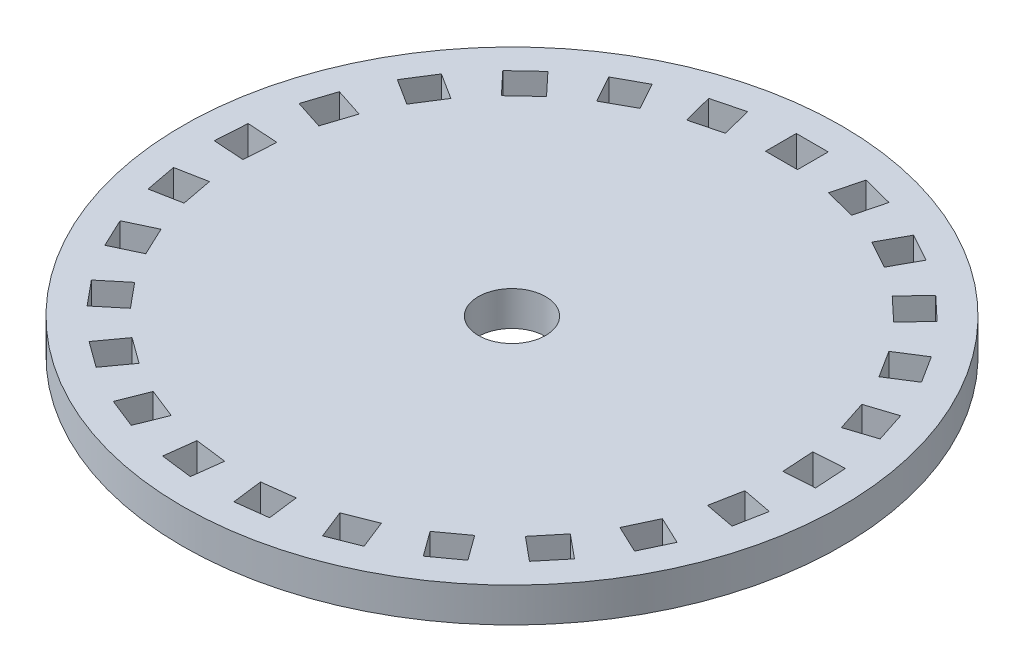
from build123d import *

# Parameters (mm, degrees)
SKETCH1_R           = 28.575
SKETCH1_R_2         = 2.921
SKETCH1_W           = 2.7686
SKETCH1_H           = 2.667
BOSS_EXTRUDE1_DEPTH = 2.9972


with BuildPart() as part:
    # Sketch1 → Boss-Extrude1 (new body)
    with BuildSketch(Plane(origin=(0, 0, 0), x_dir=(1, 0, 0), z_dir=(0, 1, 0))):
        with Locations(Location((0, 0, 0), (0, 0, 90))):
            Circle(SKETCH1_R)
        with Locations(Location((0, 0, 0), (0, 0, 90))):
            Circle(SKETCH1_R_2, mode=Mode.SUBTRACT)
        Polygon((4.470575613, 22.97811272), (5.133831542, 25.561324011), (7.815450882, 24.872801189), (7.152194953, 22.289589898), align=None, mode=Mode.SUBTRACT)
        with Locations((0, 24.7015)):
            Rectangle(SKETCH1_W, SKETCH1_H, mode=Mode.SUBTRACT)
        Polygon((10.044548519, 21.14442611), (11.329385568, 23.481536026), (13.755528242, 22.147752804), (12.470691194, 19.810642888), align=None, mode=Mode.SUBTRACT)
        Polygon((14.9873855, 17.982157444), (16.813072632, 19.926316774), (18.831295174, 18.031079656), (17.005608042, 16.086920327), align=None, mode=Mode.SUBTRACT)
        Polygon((18.988509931, 13.690003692), (21.240332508, 15.119053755), (22.723822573, 12.78144746), (20.471999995, 11.352397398), align=None, mode=Mode.SUBTRACT)
        Polygon((21.796516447, 8.53765666), (24.332984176, 9.361804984), (25.188528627, 6.728709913), (22.652060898, 5.904561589), align=None, mode=Mode.SUBTRACT)
        Polygon((23.234967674, 2.848857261), (25.896704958, 3.016319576), (26.070546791, 0.253182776), (23.408809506, 0.08572046), align=None, mode=Mode.SUBTRACT)
        Polygon((23.213480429, -3.018946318), (25.833240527, -3.518692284), (25.314456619, -6.238252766), (22.694696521, -5.7385068), align=None, mode=Mode.SUBTRACT)
        Polygon((21.733404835, -8.697058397), (24.146578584, -9.832611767), (22.967766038, -12.337715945), (20.554592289, -11.202162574), align=None, mode=Mode.SUBTRACT)
        Polygon((18.887739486, -13.82870231), (20.942698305, -15.528712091), (19.177926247, -17.661955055), (17.122967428, -15.961945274), align=None, mode=Mode.SUBTRACT)
        Polygon((14.855288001, -18.091438), (16.422911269, -20.249086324), (14.183066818, -21.876428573), (12.61544355, -19.718780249), align=None, mode=Mode.SUBTRACT)
        Polygon((9.889424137, -21.217422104), (10.871212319, -23.697135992), (8.29703314, -24.716325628), (7.315244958, -22.236611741), align=None, mode=Mode.SUBTRACT)
        Polygon((4.302171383, -23.010237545), (4.636435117, -25.656207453), (1.889666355, -26.003205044), (1.555402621, -23.357235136), align=None, mode=Mode.SUBTRACT)
        Polygon((-1.555402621, -23.357235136), (-1.889666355, -26.003205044), (-4.636435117, -25.656207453), (-4.302171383, -23.010237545), align=None, mode=Mode.SUBTRACT)
        Polygon((-7.315244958, -22.236611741), (-8.29703314, -24.716325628), (-10.871212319, -23.697135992), (-9.889424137, -21.217422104), align=None, mode=Mode.SUBTRACT)
        Polygon((-12.61544355, -19.718780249), (-14.183066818, -21.876428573), (-16.422911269, -20.249086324), (-14.855288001, -18.091438), align=None, mode=Mode.SUBTRACT)
        Polygon((-17.122967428, -15.961945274), (-19.177926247, -17.661955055), (-20.942698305, -15.528712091), (-18.887739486, -13.82870231), align=None, mode=Mode.SUBTRACT)
        Polygon((-20.554592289, -11.202162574), (-22.967766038, -12.337715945), (-24.146578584, -9.832611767), (-21.733404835, -8.697058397), align=None, mode=Mode.SUBTRACT)
        Polygon((-22.694696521, -5.7385068), (-25.314456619, -6.238252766), (-25.833240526, -3.518692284), (-23.213480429, -3.018946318), align=None, mode=Mode.SUBTRACT)
        Polygon((-23.408809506, 0.08572046), (-26.070546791, 0.253182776), (-25.896704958, 3.016319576), (-23.234967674, 2.848857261), align=None, mode=Mode.SUBTRACT)
        Polygon((-22.652060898, 5.904561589), (-25.188528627, 6.728709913), (-24.332984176, 9.361804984), (-21.796516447, 8.53765666), align=None, mode=Mode.SUBTRACT)
        Polygon((-20.471999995, 11.352397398), (-22.723822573, 12.78144746), (-21.240332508, 15.119053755), (-18.988509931, 13.690003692), align=None, mode=Mode.SUBTRACT)
        Polygon((-17.005608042, 16.086920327), (-18.831295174, 18.031079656), (-16.813072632, 19.926316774), (-14.9873855, 17.982157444), align=None, mode=Mode.SUBTRACT)
        Polygon((-12.470691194, 19.810642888), (-13.755528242, 22.147752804), (-11.329385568, 23.481536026), (-10.044548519, 21.14442611), align=None, mode=Mode.SUBTRACT)
        Polygon((-7.152194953, 22.289589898), (-7.815450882, 24.872801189), (-5.133831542, 25.561324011), (-4.470575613, 22.97811272), align=None, mode=Mode.SUBTRACT)
    extrude(amount=BOSS_EXTRUDE1_DEPTH)


solid = part.part
